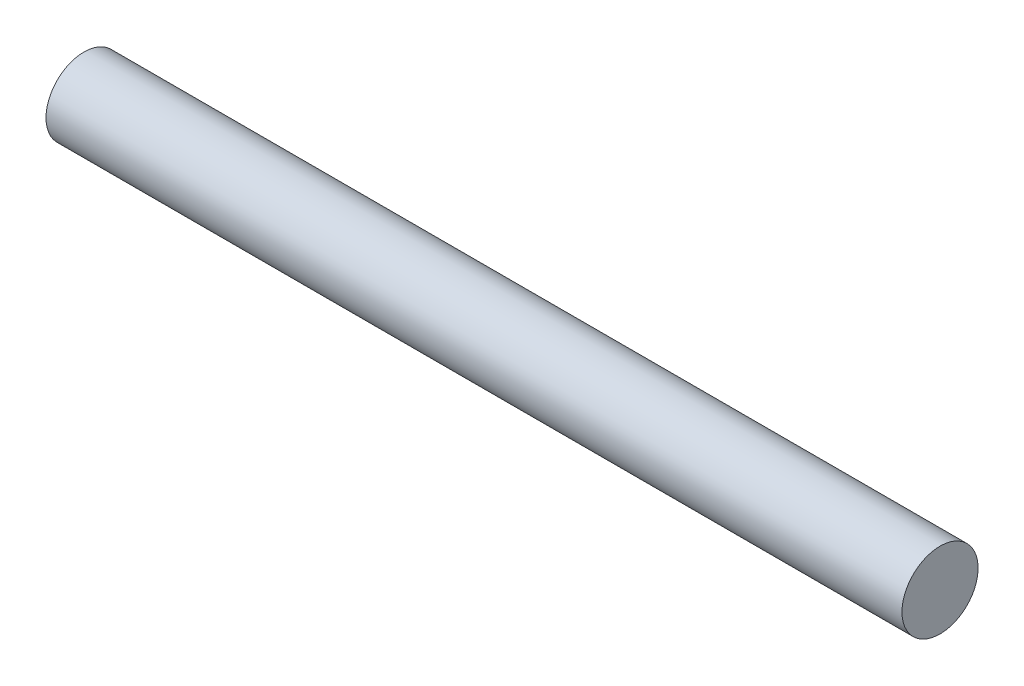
from build123d import *

# Parameters (mm, degrees)
ESQUISSE1_W = 450
ESQUISSE1_H = 20


with BuildPart() as part:
    # Esquisse1 → R_volution1 (revolve)
    with BuildSketch(Plane.XY, mode=Mode.PRIVATE) as r_volution1_sk:
        with Locations((0, 10)):
            Rectangle(ESQUISSE1_W, ESQUISSE1_H)
    revolve(r_volution1_sk.sketch.rotate(Axis((-225, 0, 0), (1, 0, 0)), 90), axis=Axis((-225, 0, 0), (1, 0, 0)))


solid = part.part
